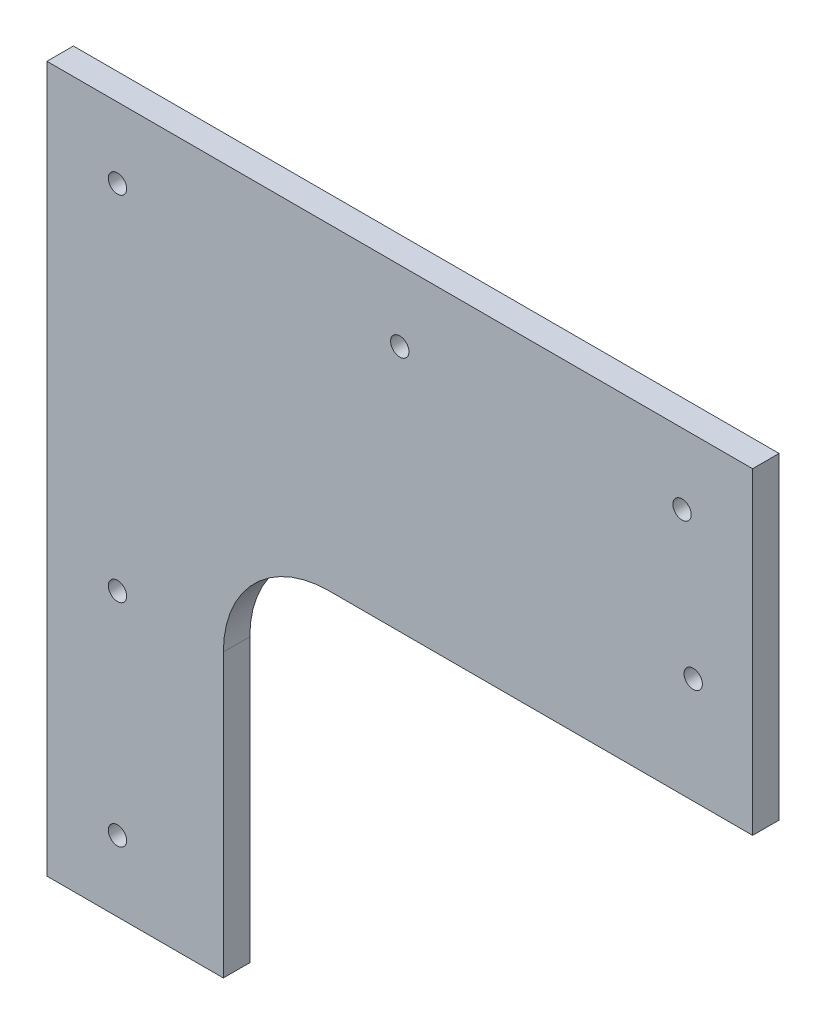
from build123d import *

# Parameters (mm, degrees)
SHAPE_DEPTH    = 9.525
FILLET1_R      = 38.1
SKETCH2_R      = 3.302
EXTRUDE2_DEPTH = 360.336507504


with BuildPart() as part:
    # Sketch1 → shape (new body)
    with BuildSketch(Plane.XY):
        Polygon((0, 0), (254, 0), (254, -114.3), (63.5, -114.3), (63.5, -254), (0, -254), align=None)
    extrude(amount=SHAPE_DEPTH)

    # Fillet1
    fillet1_edges = [part.edges().sort_by_distance(p)[0] for p in [
        (63.5, -114.3, 4.7625),
    ]]
    fillet(fillet1_edges, radius=FILLET1_R)

    # Sketch2 → Extrude2 (cut, through all)
    with BuildSketch(Plane.XY.offset(9.525)):
        with Locations((25.4, -228.6)):
            Circle(SKETCH2_R)
        with Locations((25.4, -152.4)):
            Circle(SKETCH2_R)
        with Locations((25.4, -25.4)):
            Circle(SKETCH2_R)
        with Locations((127, -25.4)):
            Circle(SKETCH2_R)
        with Locations((228.6, -25.4)):
            Circle(SKETCH2_R)
        with Locations((232.613237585, -76.2)):
            Circle(SKETCH2_R)
    extrude(amount=-EXTRUDE2_DEPTH, mode=Mode.SUBTRACT)


solid = part.part
